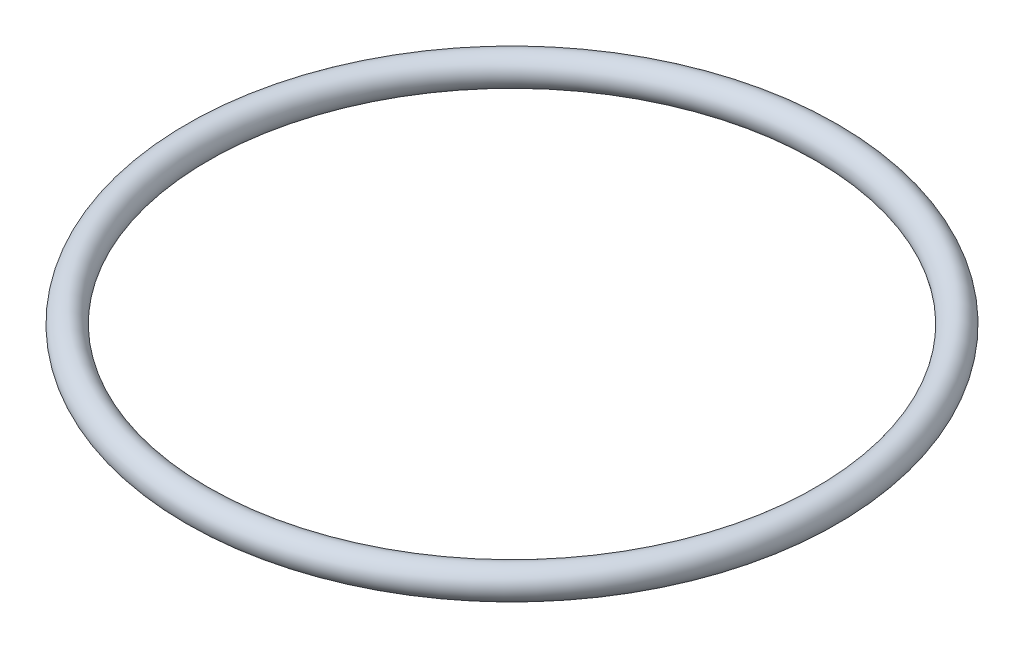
ISO-10303-21;
HEADER;
FILE_DESCRIPTION(('STEP AP214'),'2;1');
FILE_NAME('part.step','',(''),(''),'','','');
FILE_SCHEMA(('AUTOMOTIVE_DESIGN { 1 0 10303 214 1 1 1 1 }'));
ENDSEC;
DATA;
#1=APPLICATION_CONTEXT('core data for automotive mechanical design processes');
#2=APPLICATION_PROTOCOL_DEFINITION('international standard','automotive_design',2000,#1);
#3=PRODUCT_CONTEXT('',#1,'mechanical');
#4=PRODUCT('Part','Part','',(#3));
#5=PRODUCT_RELATED_PRODUCT_CATEGORY('part','',(#4));
#6=PRODUCT_DEFINITION_FORMATION('','',#4);
#7=PRODUCT_DEFINITION_CONTEXT('part definition',#1,'design');
#8=PRODUCT_DEFINITION('design','',#6,#7);
#9=PRODUCT_DEFINITION_SHAPE('','',#8);
#10=(LENGTH_UNIT() NAMED_UNIT(*) SI_UNIT(.MILLI.,.METRE.));
#11=(NAMED_UNIT(*) PLANE_ANGLE_UNIT() SI_UNIT($,.RADIAN.));
#12=(NAMED_UNIT(*) SI_UNIT($,.STERADIAN.) SOLID_ANGLE_UNIT());
#13=UNCERTAINTY_MEASURE_WITH_UNIT(LENGTH_MEASURE(1.E-05),#10,'distance_accuracy_value','');
#14=(GEOMETRIC_REPRESENTATION_CONTEXT(3) GLOBAL_UNCERTAINTY_ASSIGNED_CONTEXT((#13)) GLOBAL_UNIT_ASSIGNED_CONTEXT((#10,
#11,#12)) REPRESENTATION_CONTEXT('',''));
#15=CARTESIAN_POINT('',(0.,0.,0.));
#16=DIRECTION('',(0.,0.,1.));
#17=DIRECTION('',(1.,0.,0.));
#18=AXIS2_PLACEMENT_3D('',#15,#16,#17);
#19=CARTESIAN_POINT('',(0.,0.,0.));
#20=DIRECTION('',(0.,1.,0.));
#21=DIRECTION('',(0.,0.,1.));
#22=AXIS2_PLACEMENT_3D('',#19,#20,#21);
#23=TOROIDAL_SURFACE('',#22,26.25,1.25);
#24=CARTESIAN_POINT('',(0.,0.,27.5));
#25=VERTEX_POINT('',#24);
#26=VERTEX_LOOP('',#25);
#27=FACE_BOUND('',#26,.T.);
#28=ADVANCED_FACE('F33',(#27),#23,.T.);
#29=CLOSED_SHELL('',(#28));
#30=MANIFOLD_SOLID_BREP('B2',#29);
#31=ADVANCED_BREP_SHAPE_REPRESENTATION('',(#18,#30),#14);
#32=SHAPE_DEFINITION_REPRESENTATION(#9,#31);
ENDSEC;
END-ISO-10303-21;
